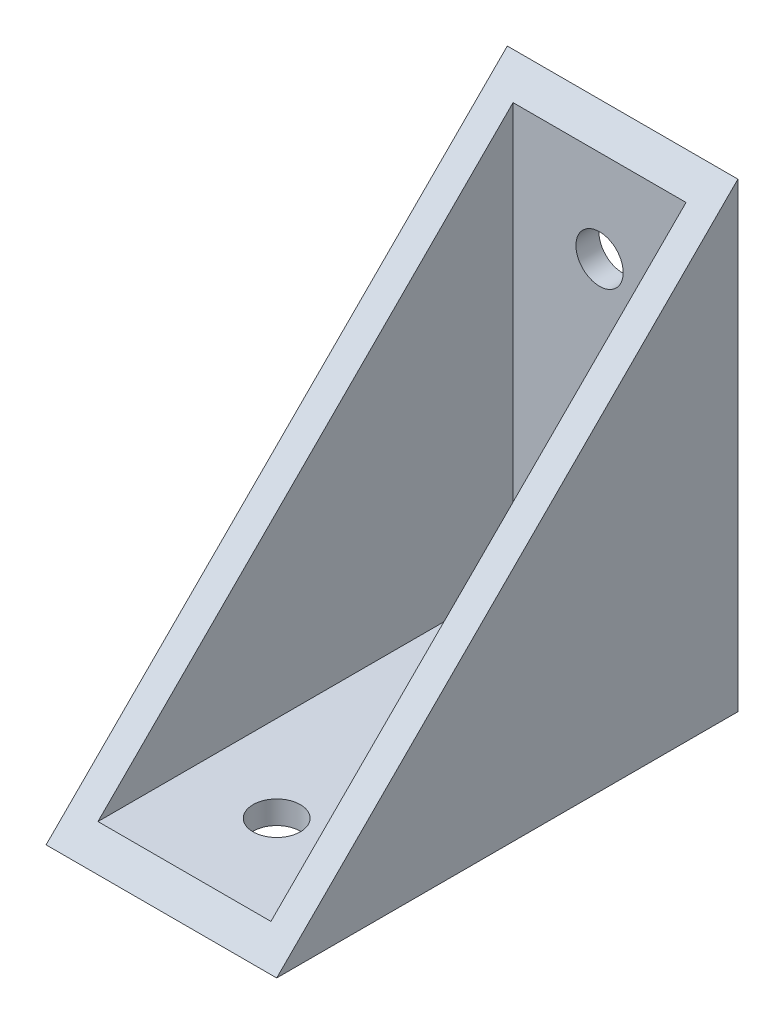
ISO-10303-21;
HEADER;
FILE_DESCRIPTION(('STEP AP214'),'2;1');
FILE_NAME('part.step','',(''),(''),'','','');
FILE_SCHEMA(('AUTOMOTIVE_DESIGN { 1 0 10303 214 1 1 1 1 }'));
ENDSEC;
DATA;
#1=APPLICATION_CONTEXT('core data for automotive mechanical design processes');
#2=APPLICATION_PROTOCOL_DEFINITION('international standard','automotive_design',2000,#1);
#3=PRODUCT_CONTEXT('',#1,'mechanical');
#4=PRODUCT('Part','Part','',(#3));
#5=PRODUCT_RELATED_PRODUCT_CATEGORY('part','',(#4));
#6=PRODUCT_DEFINITION_FORMATION('','',#4);
#7=PRODUCT_DEFINITION_CONTEXT('part definition',#1,'design');
#8=PRODUCT_DEFINITION('design','',#6,#7);
#9=PRODUCT_DEFINITION_SHAPE('','',#8);
#10=(LENGTH_UNIT() NAMED_UNIT(*) SI_UNIT(.MILLI.,.METRE.));
#11=(NAMED_UNIT(*) PLANE_ANGLE_UNIT() SI_UNIT($,.RADIAN.));
#12=(NAMED_UNIT(*) SI_UNIT($,.STERADIAN.) SOLID_ANGLE_UNIT());
#13=UNCERTAINTY_MEASURE_WITH_UNIT(LENGTH_MEASURE(1.E-05),#10,'distance_accuracy_value','');
#14=(GEOMETRIC_REPRESENTATION_CONTEXT(3) GLOBAL_UNCERTAINTY_ASSIGNED_CONTEXT((#13)) GLOBAL_UNIT_ASSIGNED_CONTEXT((#10,
#11,#12)) REPRESENTATION_CONTEXT('',''));
#15=CARTESIAN_POINT('',(0.,0.,0.));
#16=DIRECTION('',(0.,0.,1.));
#17=DIRECTION('',(1.,0.,0.));
#18=AXIS2_PLACEMENT_3D('',#15,#16,#17);
#19=CARTESIAN_POINT('',(20.,0.,80.));
#20=DIRECTION('',(0.,-0.707106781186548,-0.707106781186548));
#21=DIRECTION('',(0.,0.707106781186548,-0.707106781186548));
#22=AXIS2_PLACEMENT_3D('',#19,#20,#21);
#23=PLANE('',#22);
#24=DIRECTION('',(0.,-0.707106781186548,0.707106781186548));
#25=VECTOR('',#24,1.);
#26=CARTESIAN_POINT('',(-20.,0.,80.));
#27=LINE('',#26,#25);
#28=CARTESIAN_POINT('',(-20.,80.,0.));
#29=VERTEX_POINT('',#28);
#30=CARTESIAN_POINT('',(-20.,0.,80.));
#31=VERTEX_POINT('',#30);
#32=EDGE_CURVE('E131',#29,#31,#27,.T.);
#33=ORIENTED_EDGE('',*,*,#32,.T.);
#34=DIRECTION('',(-1.,0.,0.));
#35=VECTOR('',#34,1.);
#36=CARTESIAN_POINT('',(20.,0.,80.));
#37=LINE('',#36,#35);
#38=CARTESIAN_POINT('',(20.,0.,80.));
#39=VERTEX_POINT('',#38);
#40=EDGE_CURVE('E135',#39,#31,#37,.T.);
#41=ORIENTED_EDGE('',*,*,#40,.F.);
#42=DIRECTION('',(0.,-0.707106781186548,0.707106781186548));
#43=VECTOR('',#42,1.);
#44=CARTESIAN_POINT('',(20.,0.,80.));
#45=LINE('',#44,#43);
#46=CARTESIAN_POINT('',(20.,80.,0.));
#47=VERTEX_POINT('',#46);
#48=EDGE_CURVE('E84',#47,#39,#45,.T.);
#49=ORIENTED_EDGE('',*,*,#48,.F.);
#50=DIRECTION('',(-1.,0.,0.));
#51=VECTOR('',#50,1.);
#52=CARTESIAN_POINT('',(20.,80.,0.));
#53=LINE('',#52,#51);
#54=EDGE_CURVE('E137',#47,#29,#53,.T.);
#55=ORIENTED_EDGE('',*,*,#54,.T.);
#56=EDGE_LOOP('',(#33,#41,#49,#55));
#57=FACE_BOUND('',#56,.T.);
#58=DIRECTION('',(0.,-0.707106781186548,0.707106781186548));
#59=VECTOR('',#58,1.);
#60=CARTESIAN_POINT('',(-15.,0.,80.));
#61=LINE('',#60,#59);
#62=CARTESIAN_POINT('',(-15.,76.,3.99999999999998));
#63=VERTEX_POINT('',#62);
#64=CARTESIAN_POINT('',(-15.,4.,76.));
#65=VERTEX_POINT('',#64);
#66=EDGE_CURVE('E11',#63,#65,#61,.T.);
#67=ORIENTED_EDGE('',*,*,#66,.F.);
#68=DIRECTION('',(1.,0.,0.));
#69=VECTOR('',#68,1.);
#70=CARTESIAN_POINT('',(20.,76.,3.99999999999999));
#71=LINE('',#70,#69);
#72=CARTESIAN_POINT('',(15.,76.,3.99999999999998));
#73=VERTEX_POINT('',#72);
#74=EDGE_CURVE('E44',#63,#73,#71,.T.);
#75=ORIENTED_EDGE('',*,*,#74,.T.);
#76=DIRECTION('',(0.,-0.707106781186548,0.707106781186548));
#77=VECTOR('',#76,1.);
#78=CARTESIAN_POINT('',(15.,0.,80.));
#79=LINE('',#78,#77);
#80=CARTESIAN_POINT('',(15.,4.,76.));
#81=VERTEX_POINT('',#80);
#82=EDGE_CURVE('E139',#73,#81,#79,.T.);
#83=ORIENTED_EDGE('',*,*,#82,.T.);
#84=DIRECTION('',(-1.,0.,0.));
#85=VECTOR('',#84,1.);
#86=CARTESIAN_POINT('',(20.,4.,76.));
#87=LINE('',#86,#85);
#88=EDGE_CURVE('E142',#81,#65,#87,.T.);
#89=ORIENTED_EDGE('',*,*,#88,.T.);
#90=EDGE_LOOP('',(#67,#75,#83,#89));
#91=FACE_BOUND('',#90,.T.);
#92=ADVANCED_FACE('F35',(#57,#91),#23,.F.);
#93=CARTESIAN_POINT('',(20.,80.,0.));
#94=DIRECTION('',(0.,0.,1.));
#95=DIRECTION('',(0.,-1.,0.));
#96=AXIS2_PLACEMENT_3D('',#93,#94,#95);
#97=PLANE('',#96);
#98=CARTESIAN_POINT('',(0.,20.,0.));
#99=DIRECTION('',(0.,0.,-1.));
#100=DIRECTION('',(0.,1.,0.));
#101=AXIS2_PLACEMENT_3D('',#98,#99,#100);
#102=CIRCLE('',#101,4.1);
#103=CARTESIAN_POINT('',(0.,24.1,0.));
#104=VERTEX_POINT('',#103);
#105=EDGE_CURVE('E152',#104,#104,#102,.T.);
#106=ORIENTED_EDGE('',*,*,#105,.F.);
#107=EDGE_LOOP('',(#106));
#108=FACE_BOUND('',#107,.T.);
#109=CARTESIAN_POINT('',(0.,60.,0.));
#110=DIRECTION('',(0.,0.,-1.));
#111=DIRECTION('',(0.,1.,0.));
#112=AXIS2_PLACEMENT_3D('',#109,#110,#111);
#113=CIRCLE('',#112,4.1);
#114=CARTESIAN_POINT('',(0.,64.1,0.));
#115=VERTEX_POINT('',#114);
#116=EDGE_CURVE('E158',#115,#115,#113,.T.);
#117=ORIENTED_EDGE('',*,*,#116,.F.);
#118=EDGE_LOOP('',(#117));
#119=FACE_BOUND('',#118,.T.);
#120=DIRECTION('',(0.,1.,0.));
#121=VECTOR('',#120,1.);
#122=CARTESIAN_POINT('',(-20.,80.,0.));
#123=LINE('',#122,#121);
#124=CARTESIAN_POINT('',(-20.,0.,0.));
#125=VERTEX_POINT('',#124);
#126=EDGE_CURVE('E114',#125,#29,#123,.T.);
#127=ORIENTED_EDGE('',*,*,#126,.T.);
#128=ORIENTED_EDGE('',*,*,#54,.F.);
#129=DIRECTION('',(0.,1.,0.));
#130=VECTOR('',#129,1.);
#131=CARTESIAN_POINT('',(20.,80.,0.));
#132=LINE('',#131,#130);
#133=CARTESIAN_POINT('',(20.,0.,0.));
#134=VERTEX_POINT('',#133);
#135=EDGE_CURVE('E124',#134,#47,#132,.T.);
#136=ORIENTED_EDGE('',*,*,#135,.F.);
#137=DIRECTION('',(-1.,0.,0.));
#138=VECTOR('',#137,1.);
#139=CARTESIAN_POINT('',(20.,0.,0.));
#140=LINE('',#139,#138);
#141=EDGE_CURVE('E128',#134,#125,#140,.T.);
#142=ORIENTED_EDGE('',*,*,#141,.T.);
#143=EDGE_LOOP('',(#127,#128,#136,#142));
#144=FACE_BOUND('',#143,.T.);
#145=ADVANCED_FACE('F37',(#108,#119,#144),#97,.F.);
#146=CARTESIAN_POINT('',(20.,0.,80.));
#147=DIRECTION('',(0.,1.,0.));
#148=DIRECTION('',(0.,0.,1.));
#149=AXIS2_PLACEMENT_3D('',#146,#147,#148);
#150=PLANE('',#149);
#151=CARTESIAN_POINT('',(0.,0.,60.));
#152=DIRECTION('',(0.,-1.,0.));
#153=DIRECTION('',(0.,0.,-1.));
#154=AXIS2_PLACEMENT_3D('',#151,#152,#153);
#155=CIRCLE('',#154,4.1);
#156=CARTESIAN_POINT('',(0.,0.,55.9));
#157=VERTEX_POINT('',#156);
#158=EDGE_CURVE('E148',#157,#157,#155,.T.);
#159=ORIENTED_EDGE('',*,*,#158,.F.);
#160=EDGE_LOOP('',(#159));
#161=FACE_BOUND('',#160,.T.);
#162=CARTESIAN_POINT('',(0.,0.,20.));
#163=DIRECTION('',(0.,-1.,0.));
#164=DIRECTION('',(0.,0.,-1.));
#165=AXIS2_PLACEMENT_3D('',#162,#163,#164);
#166=CIRCLE('',#165,4.1);
#167=CARTESIAN_POINT('',(0.,0.,15.9));
#168=VERTEX_POINT('',#167);
#169=EDGE_CURVE('E156',#168,#168,#166,.T.);
#170=ORIENTED_EDGE('',*,*,#169,.F.);
#171=EDGE_LOOP('',(#170));
#172=FACE_BOUND('',#171,.T.);
#173=DIRECTION('',(0.,0.,-1.));
#174=VECTOR('',#173,1.);
#175=CARTESIAN_POINT('',(-20.,0.,80.));
#176=LINE('',#175,#174);
#177=EDGE_CURVE('E78',#31,#125,#176,.T.);
#178=ORIENTED_EDGE('',*,*,#177,.T.);
#179=ORIENTED_EDGE('',*,*,#141,.F.);
#180=DIRECTION('',(0.,0.,-1.));
#181=VECTOR('',#180,1.);
#182=CARTESIAN_POINT('',(20.,0.,80.));
#183=LINE('',#182,#181);
#184=EDGE_CURVE('E61',#39,#134,#183,.T.);
#185=ORIENTED_EDGE('',*,*,#184,.F.);
#186=ORIENTED_EDGE('',*,*,#40,.T.);
#187=EDGE_LOOP('',(#178,#179,#185,#186));
#188=FACE_BOUND('',#187,.T.);
#189=ADVANCED_FACE('F172',(#161,#172,#188),#150,.F.);
#190=CARTESIAN_POINT('',(20.,0.,0.));
#191=DIRECTION('',(1.,0.,0.));
#192=DIRECTION('',(0.,0.,-1.));
#193=AXIS2_PLACEMENT_3D('',#190,#191,#192);
#194=PLANE('',#193);
#195=ORIENTED_EDGE('',*,*,#135,.T.);
#196=ORIENTED_EDGE('',*,*,#48,.T.);
#197=ORIENTED_EDGE('',*,*,#184,.T.);
#198=EDGE_LOOP('',(#195,#196,#197));
#199=FACE_BOUND('',#198,.T.);
#200=ADVANCED_FACE('F174',(#199),#194,.T.);
#201=CARTESIAN_POINT('',(-20.,0.,0.));
#202=DIRECTION('',(1.,0.,0.));
#203=DIRECTION('',(0.,0.,-1.));
#204=AXIS2_PLACEMENT_3D('',#201,#202,#203);
#205=PLANE('',#204);
#206=ORIENTED_EDGE('',*,*,#126,.F.);
#207=ORIENTED_EDGE('',*,*,#177,.F.);
#208=ORIENTED_EDGE('',*,*,#32,.F.);
#209=EDGE_LOOP('',(#206,#207,#208));
#210=FACE_BOUND('',#209,.T.);
#211=ADVANCED_FACE('F181',(#210),#205,.F.);
#212=CARTESIAN_POINT('',(-15.,84.9571251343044,3.99999999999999));
#213=DIRECTION('',(0.,0.,-1.));
#214=DIRECTION('',(0.,1.,0.));
#215=AXIS2_PLACEMENT_3D('',#212,#213,#214);
#216=PLANE('',#215);
#217=CARTESIAN_POINT('',(0.,20.,3.99999999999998));
#218=DIRECTION('',(0.,0.,-1.));
#219=DIRECTION('',(0.,1.,0.));
#220=AXIS2_PLACEMENT_3D('',#217,#218,#219);
#221=CIRCLE('',#220,4.1);
#222=CARTESIAN_POINT('',(0.,24.1,3.99999999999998));
#223=VERTEX_POINT('',#222);
#224=EDGE_CURVE('E39',#223,#223,#221,.T.);
#225=ORIENTED_EDGE('',*,*,#224,.T.);
#226=EDGE_LOOP('',(#225));
#227=FACE_BOUND('',#226,.T.);
#228=CARTESIAN_POINT('',(0.,60.,3.99999999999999));
#229=DIRECTION('',(0.,0.,-1.));
#230=DIRECTION('',(0.,1.,0.));
#231=AXIS2_PLACEMENT_3D('',#228,#229,#230);
#232=CIRCLE('',#231,4.1);
#233=CARTESIAN_POINT('',(0.,64.1,3.99999999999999));
#234=VERTEX_POINT('',#233);
#235=EDGE_CURVE('E150',#234,#234,#232,.T.);
#236=ORIENTED_EDGE('',*,*,#235,.T.);
#237=EDGE_LOOP('',(#236));
#238=FACE_BOUND('',#237,.T.);
#239=DIRECTION('',(0.,1.,0.));
#240=VECTOR('',#239,1.);
#241=CARTESIAN_POINT('',(-15.,84.9571251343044,3.99999999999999));
#242=LINE('',#241,#240);
#243=CARTESIAN_POINT('',(-15.,4.,3.99999999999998));
#244=VERTEX_POINT('',#243);
#245=EDGE_CURVE('E103',#244,#63,#242,.T.);
#246=ORIENTED_EDGE('',*,*,#245,.F.);
#247=DIRECTION('',(1.,0.,0.));
#248=VECTOR('',#247,1.);
#249=CARTESIAN_POINT('',(-15.,4.,3.99999999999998));
#250=LINE('',#249,#248);
#251=CARTESIAN_POINT('',(15.,4.,3.99999999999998));
#252=VERTEX_POINT('',#251);
#253=EDGE_CURVE('E110',#244,#252,#250,.T.);
#254=ORIENTED_EDGE('',*,*,#253,.T.);
#255=DIRECTION('',(0.,1.,0.));
#256=VECTOR('',#255,1.);
#257=CARTESIAN_POINT('',(15.,84.9571251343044,3.99999999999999));
#258=LINE('',#257,#256);
#259=EDGE_CURVE('E107',#252,#73,#258,.T.);
#260=ORIENTED_EDGE('',*,*,#259,.T.);
#261=ORIENTED_EDGE('',*,*,#74,.F.);
#262=EDGE_LOOP('',(#246,#254,#260,#261));
#263=FACE_BOUND('',#262,.T.);
#264=ADVANCED_FACE('F116',(#227,#238,#263),#216,.F.);
#265=CARTESIAN_POINT('',(-15.,4.,91.8467587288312));
#266=DIRECTION('',(0.,-1.,0.));
#267=DIRECTION('',(0.,0.,-1.));
#268=AXIS2_PLACEMENT_3D('',#265,#266,#267);
#269=PLANE('',#268);
#270=CARTESIAN_POINT('',(0.,4.,60.));
#271=DIRECTION('',(0.,-1.,0.));
#272=DIRECTION('',(0.,0.,-1.));
#273=AXIS2_PLACEMENT_3D('',#270,#271,#272);
#274=CIRCLE('',#273,4.1);
#275=CARTESIAN_POINT('',(0.,4.,55.9));
#276=VERTEX_POINT('',#275);
#277=EDGE_CURVE('E122',#276,#276,#274,.T.);
#278=ORIENTED_EDGE('',*,*,#277,.T.);
#279=EDGE_LOOP('',(#278));
#280=FACE_BOUND('',#279,.T.);
#281=CARTESIAN_POINT('',(0.,4.,20.));
#282=DIRECTION('',(0.,-1.,0.));
#283=DIRECTION('',(0.,0.,-1.));
#284=AXIS2_PLACEMENT_3D('',#281,#282,#283);
#285=CIRCLE('',#284,4.1);
#286=CARTESIAN_POINT('',(0.,4.,15.9));
#287=VERTEX_POINT('',#286);
#288=EDGE_CURVE('E145',#287,#287,#285,.T.);
#289=ORIENTED_EDGE('',*,*,#288,.T.);
#290=EDGE_LOOP('',(#289));
#291=FACE_BOUND('',#290,.T.);
#292=DIRECTION('',(0.,0.,-1.));
#293=VECTOR('',#292,1.);
#294=CARTESIAN_POINT('',(15.,4.,91.8467587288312));
#295=LINE('',#294,#293);
#296=EDGE_CURVE('E52',#81,#252,#295,.T.);
#297=ORIENTED_EDGE('',*,*,#296,.T.);
#298=ORIENTED_EDGE('',*,*,#253,.F.);
#299=DIRECTION('',(0.,0.,-1.));
#300=VECTOR('',#299,1.);
#301=CARTESIAN_POINT('',(-15.,4.,91.8467587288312));
#302=LINE('',#301,#300);
#303=EDGE_CURVE('E99',#65,#244,#302,.T.);
#304=ORIENTED_EDGE('',*,*,#303,.F.);
#305=ORIENTED_EDGE('',*,*,#88,.F.);
#306=EDGE_LOOP('',(#297,#298,#304,#305));
#307=FACE_BOUND('',#306,.T.);
#308=ADVANCED_FACE('F111',(#280,#291,#307),#269,.F.);
#309=CARTESIAN_POINT('',(-15.,0.,0.));
#310=DIRECTION('',(1.,0.,0.));
#311=DIRECTION('',(0.,0.,-1.));
#312=AXIS2_PLACEMENT_3D('',#309,#310,#311);
#313=PLANE('',#312);
#314=ORIENTED_EDGE('',*,*,#66,.T.);
#315=ORIENTED_EDGE('',*,*,#303,.T.);
#316=ORIENTED_EDGE('',*,*,#245,.T.);
#317=EDGE_LOOP('',(#314,#315,#316));
#318=FACE_BOUND('',#317,.T.);
#319=ADVANCED_FACE('F101',(#318),#313,.T.);
#320=CARTESIAN_POINT('',(15.,0.,0.));
#321=DIRECTION('',(1.,0.,0.));
#322=DIRECTION('',(0.,0.,-1.));
#323=AXIS2_PLACEMENT_3D('',#320,#321,#322);
#324=PLANE('',#323);
#325=ORIENTED_EDGE('',*,*,#259,.F.);
#326=ORIENTED_EDGE('',*,*,#296,.F.);
#327=ORIENTED_EDGE('',*,*,#82,.F.);
#328=EDGE_LOOP('',(#325,#326,#327));
#329=FACE_BOUND('',#328,.T.);
#330=ADVANCED_FACE('F190',(#329),#324,.F.);
#331=CARTESIAN_POINT('',(0.,30.,20.));
#332=DIRECTION('',(0.,-1.,0.));
#333=DIRECTION('',(0.,0.,-1.));
#334=AXIS2_PLACEMENT_3D('',#331,#332,#333);
#335=CYLINDRICAL_SURFACE('',#334,4.1);
#336=ORIENTED_EDGE('',*,*,#169,.T.);
#337=EDGE_LOOP('',(#336));
#338=FACE_BOUND('',#337,.T.);
#339=ORIENTED_EDGE('',*,*,#288,.F.);
#340=EDGE_LOOP('',(#339));
#341=FACE_BOUND('',#340,.T.);
#342=ADVANCED_FACE('F169',(#338,#341),#335,.F.);
#343=CARTESIAN_POINT('',(0.,30.,60.));
#344=DIRECTION('',(0.,-1.,0.));
#345=DIRECTION('',(0.,0.,-1.));
#346=AXIS2_PLACEMENT_3D('',#343,#344,#345);
#347=CYLINDRICAL_SURFACE('',#346,4.1);
#348=ORIENTED_EDGE('',*,*,#158,.T.);
#349=EDGE_LOOP('',(#348));
#350=FACE_BOUND('',#349,.T.);
#351=ORIENTED_EDGE('',*,*,#277,.F.);
#352=EDGE_LOOP('',(#351));
#353=FACE_BOUND('',#352,.T.);
#354=ADVANCED_FACE('F197',(#350,#353),#347,.F.);
#355=CARTESIAN_POINT('',(0.,60.,30.));
#356=DIRECTION('',(0.,0.,-1.));
#357=DIRECTION('',(0.,1.,0.));
#358=AXIS2_PLACEMENT_3D('',#355,#356,#357);
#359=CYLINDRICAL_SURFACE('',#358,4.1);
#360=ORIENTED_EDGE('',*,*,#116,.T.);
#361=EDGE_LOOP('',(#360));
#362=FACE_BOUND('',#361,.T.);
#363=ORIENTED_EDGE('',*,*,#235,.F.);
#364=EDGE_LOOP('',(#363));
#365=FACE_BOUND('',#364,.T.);
#366=ADVANCED_FACE('F267',(#362,#365),#359,.F.);
#367=CARTESIAN_POINT('',(0.,20.,30.));
#368=DIRECTION('',(0.,0.,-1.));
#369=DIRECTION('',(0.,1.,0.));
#370=AXIS2_PLACEMENT_3D('',#367,#368,#369);
#371=CYLINDRICAL_SURFACE('',#370,4.1);
#372=ORIENTED_EDGE('',*,*,#105,.T.);
#373=EDGE_LOOP('',(#372));
#374=FACE_BOUND('',#373,.T.);
#375=ORIENTED_EDGE('',*,*,#224,.F.);
#376=EDGE_LOOP('',(#375));
#377=FACE_BOUND('',#376,.T.);
#378=ADVANCED_FACE('F281',(#374,#377),#371,.F.);
#379=CLOSED_SHELL('',(#92,#145,#189,#200,#211,#264,#308,#319,#330,#342,#354,#366,#378));
#380=MANIFOLD_SOLID_BREP('B2',#379);
#381=ADVANCED_BREP_SHAPE_REPRESENTATION('',(#18,#380),#14);
#382=SHAPE_DEFINITION_REPRESENTATION(#9,#381);
ENDSEC;
END-ISO-10303-21;
